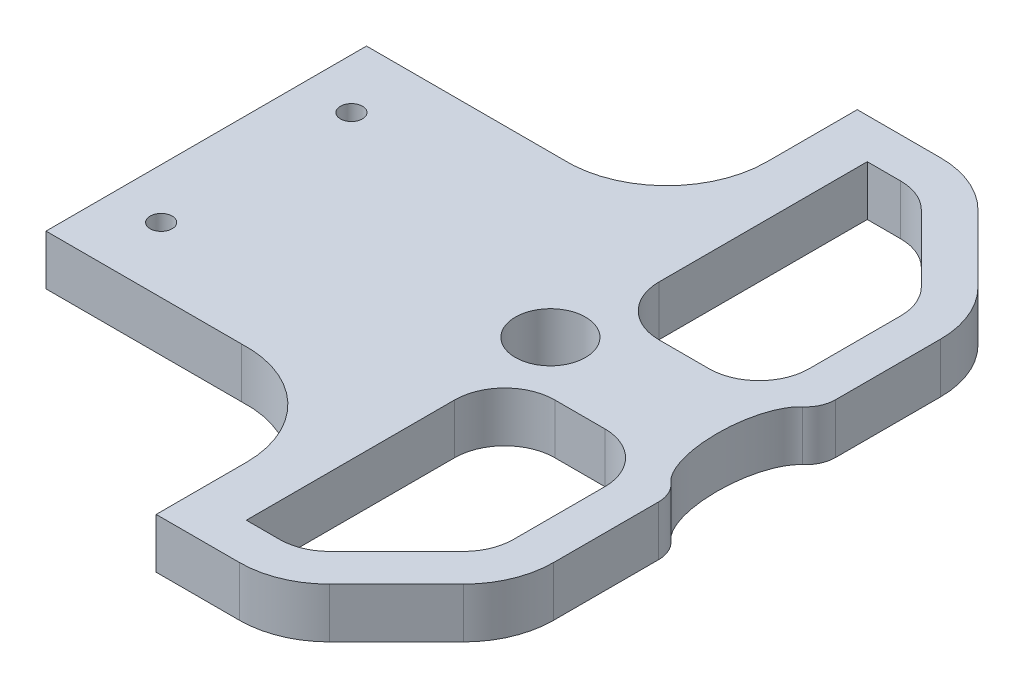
ISO-10303-21;
HEADER;
FILE_DESCRIPTION(('STEP AP214'),'2;1');
FILE_NAME('part.step','',(''),(''),'','','');
FILE_SCHEMA(('AUTOMOTIVE_DESIGN { 1 0 10303 214 1 1 1 1 }'));
ENDSEC;
DATA;
#1=APPLICATION_CONTEXT('core data for automotive mechanical design processes');
#2=APPLICATION_PROTOCOL_DEFINITION('international standard','automotive_design',2000,#1);
#3=PRODUCT_CONTEXT('',#1,'mechanical');
#4=PRODUCT('Part','Part','',(#3));
#5=PRODUCT_RELATED_PRODUCT_CATEGORY('part','',(#4));
#6=PRODUCT_DEFINITION_FORMATION('','',#4);
#7=PRODUCT_DEFINITION_CONTEXT('part definition',#1,'design');
#8=PRODUCT_DEFINITION('design','',#6,#7);
#9=PRODUCT_DEFINITION_SHAPE('','',#8);
#10=(LENGTH_UNIT() NAMED_UNIT(*) SI_UNIT(.MILLI.,.METRE.));
#11=(NAMED_UNIT(*) PLANE_ANGLE_UNIT() SI_UNIT($,.RADIAN.));
#12=(NAMED_UNIT(*) SI_UNIT($,.STERADIAN.) SOLID_ANGLE_UNIT());
#13=UNCERTAINTY_MEASURE_WITH_UNIT(LENGTH_MEASURE(1.E-05),#10,'distance_accuracy_value','');
#14=(GEOMETRIC_REPRESENTATION_CONTEXT(3) GLOBAL_UNCERTAINTY_ASSIGNED_CONTEXT((#13)) GLOBAL_UNIT_ASSIGNED_CONTEXT((#10,
#11,#12)) REPRESENTATION_CONTEXT('',''));
#15=CARTESIAN_POINT('',(0.,0.,0.));
#16=DIRECTION('',(0.,0.,1.));
#17=DIRECTION('',(1.,0.,0.));
#18=AXIS2_PLACEMENT_3D('',#15,#16,#17);
#19=CARTESIAN_POINT('',(332.,5.,0.));
#20=DIRECTION('',(0.,1.,0.));
#21=DIRECTION('',(0.,0.,1.));
#22=AXIS2_PLACEMENT_3D('',#19,#20,#21);
#23=PLANE('',#22);
#24=CARTESIAN_POINT('',(283.,5.,-9.5));
#25=DIRECTION('',(0.,1.,0.));
#26=DIRECTION('',(0.,0.,1.));
#27=AXIS2_PLACEMENT_3D('',#24,#25,#26);
#28=CIRCLE('',#27,1.09999999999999);
#29=CARTESIAN_POINT('',(283.,5.,-8.40000000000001));
#30=VERTEX_POINT('',#29);
#31=EDGE_CURVE('E320',#30,#30,#28,.T.);
#32=ORIENTED_EDGE('',*,*,#31,.F.);
#33=EDGE_LOOP('',(#32));
#34=FACE_BOUND('',#33,.T.);
#35=DIRECTION('',(-1.,0.,0.));
#36=VECTOR('',#35,1.);
#37=CARTESIAN_POINT('',(313.,5.,-31.));
#38=LINE('',#37,#36);
#39=CARTESIAN_POINT('',(316.328932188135,5.,-31.));
#40=VERTEX_POINT('',#39);
#41=CARTESIAN_POINT('',(313.,5.,-31.));
#42=VERTEX_POINT('',#41);
#43=EDGE_CURVE('E363',#40,#42,#38,.T.);
#44=ORIENTED_EDGE('',*,*,#43,.F.);
#45=CARTESIAN_POINT('',(316.328932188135,5.,-26.));
#46=DIRECTION('',(0.,1.,0.));
#47=DIRECTION('',(0.,0.,1.));
#48=AXIS2_PLACEMENT_3D('',#45,#46,#47);
#49=CIRCLE('',#48,4.99999999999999);
#50=CARTESIAN_POINT('',(319.864466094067,5.,-29.5355339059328));
#51=VERTEX_POINT('',#50);
#52=EDGE_CURVE('E361',#51,#40,#49,.T.);
#53=ORIENTED_EDGE('',*,*,#52,.F.);
#54=DIRECTION('',(-0.707106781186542,0.,-0.707106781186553));
#55=VECTOR('',#54,1.);
#56=CARTESIAN_POINT('',(319.864466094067,5.,-29.5355339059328));
#57=LINE('',#56,#55);
#58=CARTESIAN_POINT('',(326.535533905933,5.,-22.8644660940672));
#59=VERTEX_POINT('',#58);
#60=EDGE_CURVE('E379',#59,#51,#57,.T.);
#61=ORIENTED_EDGE('',*,*,#60,.F.);
#62=CARTESIAN_POINT('',(323.,5.,-19.3289321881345));
#63=DIRECTION('',(0.,1.,0.));
#64=DIRECTION('',(0.,0.,1.));
#65=AXIS2_PLACEMENT_3D('',#62,#63,#64);
#66=CIRCLE('',#65,4.99999999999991);
#67=CARTESIAN_POINT('',(328.,5.,-19.3289321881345));
#68=VERTEX_POINT('',#67);
#69=EDGE_CURVE('E376',#68,#59,#66,.T.);
#70=ORIENTED_EDGE('',*,*,#69,.F.);
#71=DIRECTION('',(0.,0.,-1.));
#72=VECTOR('',#71,1.);
#73=CARTESIAN_POINT('',(328.,5.,-10.2));
#74=LINE('',#73,#72);
#75=CARTESIAN_POINT('',(328.,5.,-10.2));
#76=VERTEX_POINT('',#75);
#77=EDGE_CURVE('E374',#76,#68,#74,.T.);
#78=ORIENTED_EDGE('',*,*,#77,.F.);
#79=CARTESIAN_POINT('',(323.,5.,-10.2));
#80=DIRECTION('',(0.,1.,0.));
#81=DIRECTION('',(0.,0.,1.));
#82=AXIS2_PLACEMENT_3D('',#79,#80,#81);
#83=CIRCLE('',#82,4.99999999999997);
#84=CARTESIAN_POINT('',(323.,5.,-5.20000000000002));
#85=VERTEX_POINT('',#84);
#86=EDGE_CURVE('E372',#85,#76,#83,.T.);
#87=ORIENTED_EDGE('',*,*,#86,.F.);
#88=DIRECTION('',(1.,0.,0.));
#89=VECTOR('',#88,1.);
#90=CARTESIAN_POINT('',(323.,5.,-5.19999999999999));
#91=LINE('',#90,#89);
#92=CARTESIAN_POINT('',(318.,5.,-5.19999999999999));
#93=VERTEX_POINT('',#92);
#94=EDGE_CURVE('E370',#93,#85,#91,.T.);
#95=ORIENTED_EDGE('',*,*,#94,.F.);
#96=CARTESIAN_POINT('',(318.,5.,-10.2));
#97=DIRECTION('',(0.,1.,0.));
#98=DIRECTION('',(0.,0.,-1.));
#99=AXIS2_PLACEMENT_3D('',#96,#97,#98);
#100=CIRCLE('',#99,5.00000000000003);
#101=CARTESIAN_POINT('',(313.,5.,-10.2));
#102=VERTEX_POINT('',#101);
#103=EDGE_CURVE('E368',#102,#93,#100,.T.);
#104=ORIENTED_EDGE('',*,*,#103,.F.);
#105=DIRECTION('',(0.,0.,1.));
#106=VECTOR('',#105,1.);
#107=CARTESIAN_POINT('',(313.,5.,-10.2));
#108=LINE('',#107,#106);
#109=EDGE_CURVE('E366',#42,#102,#108,.T.);
#110=ORIENTED_EDGE('',*,*,#109,.F.);
#111=EDGE_LOOP('',(#44,#53,#61,#70,#78,#87,#95,#104,#110));
#112=FACE_BOUND('',#111,.T.);
#113=DIRECTION('',(-1.,0.,0.));
#114=VECTOR('',#113,1.);
#115=CARTESIAN_POINT('',(308.,5.,-35.));
#116=LINE('',#115,#114);
#117=CARTESIAN_POINT('',(316.328932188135,5.,-35.));
#118=VERTEX_POINT('',#117);
#119=CARTESIAN_POINT('',(308.,5.,-35.));
#120=VERTEX_POINT('',#119);
#121=EDGE_CURVE('E427',#118,#120,#116,.T.);
#122=ORIENTED_EDGE('',*,*,#121,.T.);
#123=DIRECTION('',(0.,0.,1.));
#124=VECTOR('',#123,1.);
#125=CARTESIAN_POINT('',(308.,5.,-25.987492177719));
#126=LINE('',#125,#124);
#127=CARTESIAN_POINT('',(308.,5.,-25.987492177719));
#128=VERTEX_POINT('',#127);
#129=EDGE_CURVE('E430',#120,#128,#126,.T.);
#130=ORIENTED_EDGE('',*,*,#129,.T.);
#131=CARTESIAN_POINT('',(298.,5.,-25.987492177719));
#132=DIRECTION('',(0.,-1.,0.));
#133=DIRECTION('',(0.,0.,1.));
#134=AXIS2_PLACEMENT_3D('',#131,#132,#133);
#135=CIRCLE('',#134,10.);
#136=CARTESIAN_POINT('',(297.5,5.,-15.9999999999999));
#137=VERTEX_POINT('',#136);
#138=EDGE_CURVE('E433',#128,#137,#135,.T.);
#139=ORIENTED_EDGE('',*,*,#138,.T.);
#140=DIRECTION('',(-1.,0.,0.));
#141=VECTOR('',#140,1.);
#142=CARTESIAN_POINT('',(278.,5.,-16.));
#143=LINE('',#142,#141);
#144=CARTESIAN_POINT('',(278.,5.,-16.));
#145=VERTEX_POINT('',#144);
#146=EDGE_CURVE('E435',#137,#145,#143,.T.);
#147=ORIENTED_EDGE('',*,*,#146,.T.);
#148=DIRECTION('',(0.,0.,1.));
#149=VECTOR('',#148,1.);
#150=CARTESIAN_POINT('',(278.,5.,-16.));
#151=LINE('',#150,#149);
#152=CARTESIAN_POINT('',(278.,5.,16.));
#153=VERTEX_POINT('',#152);
#154=EDGE_CURVE('E437',#145,#153,#151,.T.);
#155=ORIENTED_EDGE('',*,*,#154,.T.);
#156=DIRECTION('',(1.,0.,0.));
#157=VECTOR('',#156,1.);
#158=CARTESIAN_POINT('',(278.,5.,16.));
#159=LINE('',#158,#157);
#160=CARTESIAN_POINT('',(297.5,5.,16.));
#161=VERTEX_POINT('',#160);
#162=EDGE_CURVE('E439',#153,#161,#159,.T.);
#163=ORIENTED_EDGE('',*,*,#162,.T.);
#164=CARTESIAN_POINT('',(298.,5.,25.987492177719));
#165=DIRECTION('',(0.,-1.,0.));
#166=DIRECTION('',(0.,0.,-1.));
#167=AXIS2_PLACEMENT_3D('',#164,#165,#166);
#168=CIRCLE('',#167,10.);
#169=CARTESIAN_POINT('',(308.,5.,25.987492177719));
#170=VERTEX_POINT('',#169);
#171=EDGE_CURVE('E441',#161,#170,#168,.T.);
#172=ORIENTED_EDGE('',*,*,#171,.T.);
#173=DIRECTION('',(0.,0.,1.));
#174=VECTOR('',#173,1.);
#175=CARTESIAN_POINT('',(308.,5.,25.987492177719));
#176=LINE('',#175,#174);
#177=CARTESIAN_POINT('',(308.,5.,35.));
#178=VERTEX_POINT('',#177);
#179=EDGE_CURVE('E443',#170,#178,#176,.T.);
#180=ORIENTED_EDGE('',*,*,#179,.T.);
#181=DIRECTION('',(1.,0.,0.));
#182=VECTOR('',#181,1.);
#183=CARTESIAN_POINT('',(308.,5.,35.));
#184=LINE('',#183,#182);
#185=CARTESIAN_POINT('',(316.328932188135,5.,35.));
#186=VERTEX_POINT('',#185);
#187=EDGE_CURVE('E445',#178,#186,#184,.T.);
#188=ORIENTED_EDGE('',*,*,#187,.T.);
#189=CARTESIAN_POINT('',(316.328932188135,5.,26.));
#190=DIRECTION('',(0.,1.,0.));
#191=DIRECTION('',(0.,0.,-1.));
#192=AXIS2_PLACEMENT_3D('',#189,#190,#191);
#193=CIRCLE('',#192,8.99999999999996);
#194=CARTESIAN_POINT('',(322.692893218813,5.,32.3639610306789));
#195=VERTEX_POINT('',#194);
#196=EDGE_CURVE('E447',#186,#195,#193,.T.);
#197=ORIENTED_EDGE('',*,*,#196,.T.);
#198=DIRECTION('',(0.70710678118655,0.,-0.707106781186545));
#199=VECTOR('',#198,1.);
#200=CARTESIAN_POINT('',(322.692893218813,5.,32.3639610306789));
#201=LINE('',#200,#199);
#202=CARTESIAN_POINT('',(329.363961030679,5.,25.6928932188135));
#203=VERTEX_POINT('',#202);
#204=EDGE_CURVE('E449',#195,#203,#201,.T.);
#205=ORIENTED_EDGE('',*,*,#204,.T.);
#206=CARTESIAN_POINT('',(323.,5.,19.3289321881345));
#207=DIRECTION('',(0.,1.,0.));
#208=DIRECTION('',(0.,0.,1.));
#209=AXIS2_PLACEMENT_3D('',#206,#207,#208);
#210=CIRCLE('',#209,9.00000000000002);
#211=CARTESIAN_POINT('',(332.,5.,19.3289321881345));
#212=VERTEX_POINT('',#211);
#213=EDGE_CURVE('E451',#203,#212,#210,.T.);
#214=ORIENTED_EDGE('',*,*,#213,.T.);
#215=DIRECTION('',(0.,0.,-1.));
#216=VECTOR('',#215,1.);
#217=CARTESIAN_POINT('',(332.,5.,8.83712997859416));
#218=LINE('',#217,#216);
#219=CARTESIAN_POINT('',(332.,5.,8.83712997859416));
#220=VERTEX_POINT('',#219);
#221=EDGE_CURVE('E453',#212,#220,#218,.T.);
#222=ORIENTED_EDGE('',*,*,#221,.T.);
#223=CARTESIAN_POINT('',(329.,5.,8.83712997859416));
#224=DIRECTION('',(0.,1.,0.));
#225=DIRECTION('',(0.,0.,-1.));
#226=AXIS2_PLACEMENT_3D('',#223,#224,#225);
#227=CIRCLE('',#226,2.99999999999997);
#228=CARTESIAN_POINT('',(330.959643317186,5.,6.56561108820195));
#229=VERTEX_POINT('',#228);
#230=EDGE_CURVE('E455',#220,#229,#227,.T.);
#231=ORIENTED_EDGE('',*,*,#230,.T.);
#232=CARTESIAN_POINT('',(332.,5.,0.));
#233=DIRECTION('',(0.,-1.,0.));
#234=DIRECTION('',(0.,0.,1.));
#235=AXIS2_PLACEMENT_3D('',#232,#233,#234);
#236=ELLIPSE('',#235,7.,3.);
#237=CARTESIAN_POINT('',(330.959643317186,5.,-6.56561108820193));
#238=VERTEX_POINT('',#237);
#239=EDGE_CURVE('E457',#229,#238,#236,.T.);
#240=ORIENTED_EDGE('',*,*,#239,.T.);
#241=CARTESIAN_POINT('',(329.,5.,-8.83712997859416));
#242=DIRECTION('',(0.,1.,0.));
#243=DIRECTION('',(0.,0.,1.));
#244=AXIS2_PLACEMENT_3D('',#241,#242,#243);
#245=CIRCLE('',#244,2.99999999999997);
#246=CARTESIAN_POINT('',(332.,5.,-8.83712997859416));
#247=VERTEX_POINT('',#246);
#248=EDGE_CURVE('E460',#238,#247,#245,.T.);
#249=ORIENTED_EDGE('',*,*,#248,.T.);
#250=DIRECTION('',(0.,0.,-1.));
#251=VECTOR('',#250,1.);
#252=CARTESIAN_POINT('',(332.,5.,-19.3289321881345));
#253=LINE('',#252,#251);
#254=CARTESIAN_POINT('',(332.,5.,-19.3289321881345));
#255=VERTEX_POINT('',#254);
#256=EDGE_CURVE('E716',#247,#255,#253,.T.);
#257=ORIENTED_EDGE('',*,*,#256,.T.);
#258=CARTESIAN_POINT('',(323.,5.,-19.3289321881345));
#259=DIRECTION('',(0.,1.,0.));
#260=DIRECTION('',(0.,0.,-1.));
#261=AXIS2_PLACEMENT_3D('',#258,#259,#260);
#262=CIRCLE('',#261,8.99999999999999);
#263=CARTESIAN_POINT('',(329.363961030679,5.,-25.6928932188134));
#264=VERTEX_POINT('',#263);
#265=EDGE_CURVE('E575',#255,#264,#262,.T.);
#266=ORIENTED_EDGE('',*,*,#265,.T.);
#267=DIRECTION('',(-0.707106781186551,0.,-0.707106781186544));
#268=VECTOR('',#267,1.);
#269=CARTESIAN_POINT('',(322.692893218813,5.,-32.3639610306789));
#270=LINE('',#269,#268);
#271=CARTESIAN_POINT('',(322.692893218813,5.,-32.3639610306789));
#272=VERTEX_POINT('',#271);
#273=EDGE_CURVE('E714',#264,#272,#270,.T.);
#274=ORIENTED_EDGE('',*,*,#273,.T.);
#275=CARTESIAN_POINT('',(316.328932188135,5.,-26.));
#276=DIRECTION('',(0.,1.,0.));
#277=DIRECTION('',(0.,0.,1.));
#278=AXIS2_PLACEMENT_3D('',#275,#276,#277);
#279=CIRCLE('',#278,8.99999999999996);
#280=EDGE_CURVE('E592',#272,#118,#279,.T.);
#281=ORIENTED_EDGE('',*,*,#280,.T.);
#282=EDGE_LOOP('',(#122,#130,#139,#147,#155,#163,#172,#180,#188,#197,#205,#214,#222,#231,#240,
#249,#257,#266,#274,#281));
#283=FACE_BOUND('',#282,.T.);
#284=CARTESIAN_POINT('',(283.,5.,9.5));
#285=DIRECTION('',(0.,1.,0.));
#286=DIRECTION('',(0.,0.,-1.));
#287=AXIS2_PLACEMENT_3D('',#284,#285,#286);
#288=CIRCLE('',#287,1.09999999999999);
#289=CARTESIAN_POINT('',(283.,5.,8.40000000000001));
#290=VERTEX_POINT('',#289);
#291=EDGE_CURVE('E355',#290,#290,#288,.T.);
#292=ORIENTED_EDGE('',*,*,#291,.F.);
#293=EDGE_LOOP('',(#292));
#294=FACE_BOUND('',#293,.T.);
#295=DIRECTION('',(0.,0.,1.));
#296=VECTOR('',#295,1.);
#297=CARTESIAN_POINT('',(313.,5.,10.2));
#298=LINE('',#297,#296);
#299=CARTESIAN_POINT('',(313.,5.,10.2));
#300=VERTEX_POINT('',#299);
#301=CARTESIAN_POINT('',(313.,5.,31.));
#302=VERTEX_POINT('',#301);
#303=EDGE_CURVE('E288',#300,#302,#298,.T.);
#304=ORIENTED_EDGE('',*,*,#303,.F.);
#305=CARTESIAN_POINT('',(318.,5.,10.2));
#306=DIRECTION('',(0.,1.,0.));
#307=DIRECTION('',(0.,0.,1.));
#308=AXIS2_PLACEMENT_3D('',#305,#306,#307);
#309=CIRCLE('',#308,5.00000000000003);
#310=CARTESIAN_POINT('',(318.,5.,5.19999999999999));
#311=VERTEX_POINT('',#310);
#312=EDGE_CURVE('E280',#311,#300,#309,.T.);
#313=ORIENTED_EDGE('',*,*,#312,.F.);
#314=DIRECTION('',(-1.,0.,0.));
#315=VECTOR('',#314,1.);
#316=CARTESIAN_POINT('',(323.,5.,5.19999999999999));
#317=LINE('',#316,#315);
#318=CARTESIAN_POINT('',(323.,5.,5.19999999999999));
#319=VERTEX_POINT('',#318);
#320=EDGE_CURVE('E317',#319,#311,#317,.T.);
#321=ORIENTED_EDGE('',*,*,#320,.F.);
#322=CARTESIAN_POINT('',(323.,5.,10.2));
#323=DIRECTION('',(0.,1.,0.));
#324=DIRECTION('',(0.,0.,-1.));
#325=AXIS2_PLACEMENT_3D('',#322,#323,#324);
#326=CIRCLE('',#325,4.99999999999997);
#327=CARTESIAN_POINT('',(328.,5.,10.2));
#328=VERTEX_POINT('',#327);
#329=EDGE_CURVE('E315',#328,#319,#326,.T.);
#330=ORIENTED_EDGE('',*,*,#329,.F.);
#331=DIRECTION('',(0.,0.,-1.));
#332=VECTOR('',#331,1.);
#333=CARTESIAN_POINT('',(328.,5.,10.2));
#334=LINE('',#333,#332);
#335=CARTESIAN_POINT('',(328.,5.,19.3289321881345));
#336=VERTEX_POINT('',#335);
#337=EDGE_CURVE('E313',#336,#328,#334,.T.);
#338=ORIENTED_EDGE('',*,*,#337,.F.);
#339=CARTESIAN_POINT('',(323.,5.,19.3289321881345));
#340=DIRECTION('',(0.,1.,0.));
#341=DIRECTION('',(0.,0.,-1.));
#342=AXIS2_PLACEMENT_3D('',#339,#340,#341);
#343=CIRCLE('',#342,4.99999999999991);
#344=CARTESIAN_POINT('',(326.535533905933,5.,22.8644660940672));
#345=VERTEX_POINT('',#344);
#346=EDGE_CURVE('E311',#345,#336,#343,.T.);
#347=ORIENTED_EDGE('',*,*,#346,.F.);
#348=DIRECTION('',(0.707106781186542,0.,-0.707106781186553));
#349=VECTOR('',#348,1.);
#350=CARTESIAN_POINT('',(319.864466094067,5.,29.5355339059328));
#351=LINE('',#350,#349);
#352=CARTESIAN_POINT('',(319.864466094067,5.,29.5355339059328));
#353=VERTEX_POINT('',#352);
#354=EDGE_CURVE('E309',#353,#345,#351,.T.);
#355=ORIENTED_EDGE('',*,*,#354,.F.);
#356=CARTESIAN_POINT('',(316.328932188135,5.,26.));
#357=DIRECTION('',(0.,1.,0.));
#358=DIRECTION('',(0.,0.,-1.));
#359=AXIS2_PLACEMENT_3D('',#356,#357,#358);
#360=CIRCLE('',#359,4.99999999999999);
#361=CARTESIAN_POINT('',(316.328932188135,5.,31.));
#362=VERTEX_POINT('',#361);
#363=EDGE_CURVE('E304',#362,#353,#360,.T.);
#364=ORIENTED_EDGE('',*,*,#363,.F.);
#365=DIRECTION('',(1.,0.,0.));
#366=VECTOR('',#365,1.);
#367=CARTESIAN_POINT('',(313.,5.,31.));
#368=LINE('',#367,#366);
#369=EDGE_CURVE('E302',#302,#362,#368,.T.);
#370=ORIENTED_EDGE('',*,*,#369,.F.);
#371=EDGE_LOOP('',(#304,#313,#321,#330,#338,#347,#355,#364,#370));
#372=FACE_BOUND('',#371,.T.);
#373=CARTESIAN_POINT('',(312.364466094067,5.,0.));
#374=DIRECTION('',(0.,1.,0.));
#375=DIRECTION('',(0.,0.,1.));
#376=AXIS2_PLACEMENT_3D('',#373,#374,#375);
#377=CIRCLE('',#376,3.50000000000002);
#378=CARTESIAN_POINT('',(312.364466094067,5.,3.50000000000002));
#379=VERTEX_POINT('',#378);
#380=EDGE_CURVE('E1078',#379,#379,#377,.T.);
#381=ORIENTED_EDGE('',*,*,#380,.F.);
#382=EDGE_LOOP('',(#381));
#383=FACE_BOUND('',#382,.T.);
#384=ADVANCED_FACE('F35',(#34,#112,#283,#294,#372,#383),#23,.T.);
#385=CARTESIAN_POINT('',(332.,0.,0.));
#386=DIRECTION('',(0.,1.,0.));
#387=DIRECTION('',(0.,0.,1.));
#388=AXIS2_PLACEMENT_3D('',#385,#386,#387);
#389=PLANE('',#388);
#390=CARTESIAN_POINT('',(283.,0.,9.5));
#391=DIRECTION('',(0.,1.,0.));
#392=DIRECTION('',(0.,0.,-1.));
#393=AXIS2_PLACEMENT_3D('',#390,#391,#392);
#394=CIRCLE('',#393,1.09999999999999);
#395=CARTESIAN_POINT('',(283.,0.,8.40000000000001));
#396=VERTEX_POINT('',#395);
#397=EDGE_CURVE('E296',#396,#396,#394,.T.);
#398=ORIENTED_EDGE('',*,*,#397,.T.);
#399=EDGE_LOOP('',(#398));
#400=FACE_BOUND('',#399,.T.);
#401=CARTESIAN_POINT('',(316.328932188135,0.,-26.));
#402=DIRECTION('',(0.,1.,0.));
#403=DIRECTION('',(0.,0.,1.));
#404=AXIS2_PLACEMENT_3D('',#401,#402,#403);
#405=CIRCLE('',#404,4.99999999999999);
#406=CARTESIAN_POINT('',(319.864466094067,0.,-29.5355339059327));
#407=VERTEX_POINT('',#406);
#408=CARTESIAN_POINT('',(316.328932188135,0.,-31.));
#409=VERTEX_POINT('',#408);
#410=EDGE_CURVE('E358',#407,#409,#405,.T.);
#411=ORIENTED_EDGE('',*,*,#410,.T.);
#412=DIRECTION('',(-1.,0.,0.));
#413=VECTOR('',#412,1.);
#414=CARTESIAN_POINT('',(313.,0.,-31.));
#415=LINE('',#414,#413);
#416=CARTESIAN_POINT('',(313.,0.,-31.));
#417=VERTEX_POINT('',#416);
#418=EDGE_CURVE('E384',#409,#417,#415,.T.);
#419=ORIENTED_EDGE('',*,*,#418,.T.);
#420=DIRECTION('',(0.,0.,1.));
#421=VECTOR('',#420,1.);
#422=CARTESIAN_POINT('',(313.,0.,-10.2));
#423=LINE('',#422,#421);
#424=CARTESIAN_POINT('',(313.,0.,-10.2));
#425=VERTEX_POINT('',#424);
#426=EDGE_CURVE('E387',#417,#425,#423,.T.);
#427=ORIENTED_EDGE('',*,*,#426,.T.);
#428=CARTESIAN_POINT('',(318.,0.,-10.2));
#429=DIRECTION('',(0.,1.,0.));
#430=DIRECTION('',(0.,0.,-1.));
#431=AXIS2_PLACEMENT_3D('',#428,#429,#430);
#432=CIRCLE('',#431,5.00000000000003);
#433=CARTESIAN_POINT('',(318.,0.,-5.19999999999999));
#434=VERTEX_POINT('',#433);
#435=EDGE_CURVE('E390',#425,#434,#432,.T.);
#436=ORIENTED_EDGE('',*,*,#435,.T.);
#437=DIRECTION('',(1.,0.,0.));
#438=VECTOR('',#437,1.);
#439=CARTESIAN_POINT('',(323.,0.,-5.19999999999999));
#440=LINE('',#439,#438);
#441=CARTESIAN_POINT('',(323.,0.,-5.20000000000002));
#442=VERTEX_POINT('',#441);
#443=EDGE_CURVE('E393',#434,#442,#440,.T.);
#444=ORIENTED_EDGE('',*,*,#443,.T.);
#445=CARTESIAN_POINT('',(323.,0.,-10.2));
#446=DIRECTION('',(0.,1.,0.));
#447=DIRECTION('',(0.,0.,1.));
#448=AXIS2_PLACEMENT_3D('',#445,#446,#447);
#449=CIRCLE('',#448,4.99999999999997);
#450=CARTESIAN_POINT('',(328.,0.,-10.2));
#451=VERTEX_POINT('',#450);
#452=EDGE_CURVE('E396',#442,#451,#449,.T.);
#453=ORIENTED_EDGE('',*,*,#452,.T.);
#454=DIRECTION('',(0.,0.,-1.));
#455=VECTOR('',#454,1.);
#456=CARTESIAN_POINT('',(328.,0.,-10.2));
#457=LINE('',#456,#455);
#458=CARTESIAN_POINT('',(328.,0.,-19.3289321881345));
#459=VERTEX_POINT('',#458);
#460=EDGE_CURVE('E399',#451,#459,#457,.T.);
#461=ORIENTED_EDGE('',*,*,#460,.T.);
#462=CARTESIAN_POINT('',(323.,0.,-19.3289321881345));
#463=DIRECTION('',(0.,1.,0.));
#464=DIRECTION('',(0.,0.,1.));
#465=AXIS2_PLACEMENT_3D('',#462,#463,#464);
#466=CIRCLE('',#465,4.99999999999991);
#467=CARTESIAN_POINT('',(326.535533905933,0.,-22.8644660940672));
#468=VERTEX_POINT('',#467);
#469=EDGE_CURVE('E402',#459,#468,#466,.T.);
#470=ORIENTED_EDGE('',*,*,#469,.T.);
#471=DIRECTION('',(-0.707106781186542,0.,-0.707106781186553));
#472=VECTOR('',#471,1.);
#473=CARTESIAN_POINT('',(319.864466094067,0.,-29.5355339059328));
#474=LINE('',#473,#472);
#475=EDGE_CURVE('E364',#468,#407,#474,.T.);
#476=ORIENTED_EDGE('',*,*,#475,.T.);
#477=EDGE_LOOP('',(#411,#419,#427,#436,#444,#453,#461,#470,#476));
#478=FACE_BOUND('',#477,.T.);
#479=DIRECTION('',(-1.,0.,0.));
#480=VECTOR('',#479,1.);
#481=CARTESIAN_POINT('',(308.,0.,-35.));
#482=LINE('',#481,#480);
#483=CARTESIAN_POINT('',(316.328932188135,0.,-35.));
#484=VERTEX_POINT('',#483);
#485=CARTESIAN_POINT('',(308.,0.,-35.));
#486=VERTEX_POINT('',#485);
#487=EDGE_CURVE('E426',#484,#486,#482,.T.);
#488=ORIENTED_EDGE('',*,*,#487,.F.);
#489=CARTESIAN_POINT('',(316.328932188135,0.,-26.));
#490=DIRECTION('',(0.,1.,0.));
#491=DIRECTION('',(0.,0.,1.));
#492=AXIS2_PLACEMENT_3D('',#489,#490,#491);
#493=CIRCLE('',#492,8.99999999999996);
#494=CARTESIAN_POINT('',(322.692893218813,0.,-32.3639610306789));
#495=VERTEX_POINT('',#494);
#496=EDGE_CURVE('E431',#495,#484,#493,.T.);
#497=ORIENTED_EDGE('',*,*,#496,.F.);
#498=DIRECTION('',(-0.707106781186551,0.,-0.707106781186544));
#499=VECTOR('',#498,1.);
#500=CARTESIAN_POINT('',(322.692893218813,0.,-32.3639610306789));
#501=LINE('',#500,#499);
#502=CARTESIAN_POINT('',(329.363961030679,0.,-25.6928932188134));
#503=VERTEX_POINT('',#502);
#504=EDGE_CURVE('E582',#503,#495,#501,.T.);
#505=ORIENTED_EDGE('',*,*,#504,.F.);
#506=CARTESIAN_POINT('',(323.,0.,-19.3289321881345));
#507=DIRECTION('',(0.,1.,0.));
#508=DIRECTION('',(0.,0.,-1.));
#509=AXIS2_PLACEMENT_3D('',#506,#507,#508);
#510=CIRCLE('',#509,8.99999999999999);
#511=CARTESIAN_POINT('',(332.,0.,-19.3289321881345));
#512=VERTEX_POINT('',#511);
#513=EDGE_CURVE('E570',#512,#503,#510,.T.);
#514=ORIENTED_EDGE('',*,*,#513,.F.);
#515=DIRECTION('',(0.,0.,-1.));
#516=VECTOR('',#515,1.);
#517=CARTESIAN_POINT('',(332.,0.,-19.3289321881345));
#518=LINE('',#517,#516);
#519=CARTESIAN_POINT('',(332.,0.,-8.83712997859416));
#520=VERTEX_POINT('',#519);
#521=EDGE_CURVE('E560',#520,#512,#518,.T.);
#522=ORIENTED_EDGE('',*,*,#521,.F.);
#523=CARTESIAN_POINT('',(329.,0.,-8.83712997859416));
#524=DIRECTION('',(0.,1.,0.));
#525=DIRECTION('',(0.,0.,1.));
#526=AXIS2_PLACEMENT_3D('',#523,#524,#525);
#527=CIRCLE('',#526,2.99999999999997);
#528=CARTESIAN_POINT('',(330.959643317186,0.,-6.56561108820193));
#529=VERTEX_POINT('',#528);
#530=EDGE_CURVE('E571',#529,#520,#527,.T.);
#531=ORIENTED_EDGE('',*,*,#530,.F.);
#532=CARTESIAN_POINT('',(332.,0.,0.));
#533=DIRECTION('',(0.,-1.,0.));
#534=DIRECTION('',(0.,0.,1.));
#535=AXIS2_PLACEMENT_3D('',#532,#533,#534);
#536=ELLIPSE('',#535,7.,3.);
#537=CARTESIAN_POINT('',(330.959643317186,0.,6.56561108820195));
#538=VERTEX_POINT('',#537);
#539=EDGE_CURVE('E670',#538,#529,#536,.T.);
#540=ORIENTED_EDGE('',*,*,#539,.F.);
#541=CARTESIAN_POINT('',(329.,0.,8.83712997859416));
#542=DIRECTION('',(0.,1.,0.));
#543=DIRECTION('',(0.,0.,-1.));
#544=AXIS2_PLACEMENT_3D('',#541,#542,#543);
#545=CIRCLE('',#544,2.99999999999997);
#546=CARTESIAN_POINT('',(332.,0.,8.83712997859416));
#547=VERTEX_POINT('',#546);
#548=EDGE_CURVE('E668',#547,#538,#545,.T.);
#549=ORIENTED_EDGE('',*,*,#548,.F.);
#550=DIRECTION('',(0.,0.,-1.));
#551=VECTOR('',#550,1.);
#552=CARTESIAN_POINT('',(332.,0.,8.83712997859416));
#553=LINE('',#552,#551);
#554=CARTESIAN_POINT('',(332.,0.,19.3289321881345));
#555=VERTEX_POINT('',#554);
#556=EDGE_CURVE('E666',#555,#547,#553,.T.);
#557=ORIENTED_EDGE('',*,*,#556,.F.);
#558=CARTESIAN_POINT('',(323.,0.,19.3289321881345));
#559=DIRECTION('',(0.,1.,0.));
#560=DIRECTION('',(0.,0.,1.));
#561=AXIS2_PLACEMENT_3D('',#558,#559,#560);
#562=CIRCLE('',#561,9.00000000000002);
#563=CARTESIAN_POINT('',(329.363961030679,0.,25.6928932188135));
#564=VERTEX_POINT('',#563);
#565=EDGE_CURVE('E664',#564,#555,#562,.T.);
#566=ORIENTED_EDGE('',*,*,#565,.F.);
#567=DIRECTION('',(0.70710678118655,0.,-0.707106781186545));
#568=VECTOR('',#567,1.);
#569=CARTESIAN_POINT('',(322.692893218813,0.,32.3639610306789));
#570=LINE('',#569,#568);
#571=CARTESIAN_POINT('',(322.692893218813,0.,32.3639610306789));
#572=VERTEX_POINT('',#571);
#573=EDGE_CURVE('E662',#572,#564,#570,.T.);
#574=ORIENTED_EDGE('',*,*,#573,.F.);
#575=CARTESIAN_POINT('',(316.328932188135,0.,26.));
#576=DIRECTION('',(0.,1.,0.));
#577=DIRECTION('',(0.,0.,-1.));
#578=AXIS2_PLACEMENT_3D('',#575,#576,#577);
#579=CIRCLE('',#578,8.99999999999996);
#580=CARTESIAN_POINT('',(316.328932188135,0.,35.));
#581=VERTEX_POINT('',#580);
#582=EDGE_CURVE('E660',#581,#572,#579,.T.);
#583=ORIENTED_EDGE('',*,*,#582,.F.);
#584=DIRECTION('',(1.,0.,0.));
#585=VECTOR('',#584,1.);
#586=CARTESIAN_POINT('',(308.,0.,35.));
#587=LINE('',#586,#585);
#588=CARTESIAN_POINT('',(308.,0.,35.));
#589=VERTEX_POINT('',#588);
#590=EDGE_CURVE('E658',#589,#581,#587,.T.);
#591=ORIENTED_EDGE('',*,*,#590,.F.);
#592=DIRECTION('',(0.,0.,1.));
#593=VECTOR('',#592,1.);
#594=CARTESIAN_POINT('',(308.,0.,25.987492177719));
#595=LINE('',#594,#593);
#596=CARTESIAN_POINT('',(308.,0.,25.987492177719));
#597=VERTEX_POINT('',#596);
#598=EDGE_CURVE('E656',#597,#589,#595,.T.);
#599=ORIENTED_EDGE('',*,*,#598,.F.);
#600=CARTESIAN_POINT('',(298.,0.,25.987492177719));
#601=DIRECTION('',(0.,-1.,0.));
#602=DIRECTION('',(0.,0.,-1.));
#603=AXIS2_PLACEMENT_3D('',#600,#601,#602);
#604=CIRCLE('',#603,10.);
#605=CARTESIAN_POINT('',(297.5,0.,16.));
#606=VERTEX_POINT('',#605);
#607=EDGE_CURVE('E654',#606,#597,#604,.T.);
#608=ORIENTED_EDGE('',*,*,#607,.F.);
#609=DIRECTION('',(1.,0.,0.));
#610=VECTOR('',#609,1.);
#611=CARTESIAN_POINT('',(278.,0.,16.));
#612=LINE('',#611,#610);
#613=CARTESIAN_POINT('',(278.,0.,16.));
#614=VERTEX_POINT('',#613);
#615=EDGE_CURVE('E652',#614,#606,#612,.T.);
#616=ORIENTED_EDGE('',*,*,#615,.F.);
#617=DIRECTION('',(0.,0.,1.));
#618=VECTOR('',#617,1.);
#619=CARTESIAN_POINT('',(278.,0.,-16.));
#620=LINE('',#619,#618);
#621=CARTESIAN_POINT('',(278.,0.,-16.));
#622=VERTEX_POINT('',#621);
#623=EDGE_CURVE('E646',#622,#614,#620,.T.);
#624=ORIENTED_EDGE('',*,*,#623,.F.);
#625=DIRECTION('',(-1.,0.,0.));
#626=VECTOR('',#625,1.);
#627=CARTESIAN_POINT('',(278.,0.,-16.));
#628=LINE('',#627,#626);
#629=CARTESIAN_POINT('',(297.5,0.,-15.9999999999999));
#630=VERTEX_POINT('',#629);
#631=EDGE_CURVE('E644',#630,#622,#628,.T.);
#632=ORIENTED_EDGE('',*,*,#631,.F.);
#633=CARTESIAN_POINT('',(298.,0.,-25.987492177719));
#634=DIRECTION('',(0.,-1.,0.));
#635=DIRECTION('',(0.,0.,1.));
#636=AXIS2_PLACEMENT_3D('',#633,#634,#635);
#637=CIRCLE('',#636,10.);
#638=CARTESIAN_POINT('',(308.,0.,-25.987492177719));
#639=VERTEX_POINT('',#638);
#640=EDGE_CURVE('E640',#639,#630,#637,.T.);
#641=ORIENTED_EDGE('',*,*,#640,.F.);
#642=DIRECTION('',(0.,0.,1.));
#643=VECTOR('',#642,1.);
#644=CARTESIAN_POINT('',(308.,0.,-25.987492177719));
#645=LINE('',#644,#643);
#646=EDGE_CURVE('E642',#486,#639,#645,.T.);
#647=ORIENTED_EDGE('',*,*,#646,.F.);
#648=EDGE_LOOP('',(#488,#497,#505,#514,#522,#531,#540,#549,#557,#566,#574,#583,#591,#599,#608,
#616,#624,#632,#641,#647));
#649=FACE_BOUND('',#648,.T.);
#650=CARTESIAN_POINT('',(318.,0.,10.2));
#651=DIRECTION('',(0.,1.,0.));
#652=DIRECTION('',(0.,0.,1.));
#653=AXIS2_PLACEMENT_3D('',#650,#651,#652);
#654=CIRCLE('',#653,5.00000000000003);
#655=CARTESIAN_POINT('',(318.,0.,5.19999999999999));
#656=VERTEX_POINT('',#655);
#657=CARTESIAN_POINT('',(313.,0.,10.2));
#658=VERTEX_POINT('',#657);
#659=EDGE_CURVE('E58',#656,#658,#654,.T.);
#660=ORIENTED_EDGE('',*,*,#659,.T.);
#661=DIRECTION('',(0.,0.,1.));
#662=VECTOR('',#661,1.);
#663=CARTESIAN_POINT('',(313.,0.,10.2));
#664=LINE('',#663,#662);
#665=CARTESIAN_POINT('',(313.,0.,31.));
#666=VERTEX_POINT('',#665);
#667=EDGE_CURVE('E295',#658,#666,#664,.T.);
#668=ORIENTED_EDGE('',*,*,#667,.T.);
#669=DIRECTION('',(1.,0.,0.));
#670=VECTOR('',#669,1.);
#671=CARTESIAN_POINT('',(313.,0.,31.));
#672=LINE('',#671,#670);
#673=CARTESIAN_POINT('',(316.328932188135,0.,31.));
#674=VERTEX_POINT('',#673);
#675=EDGE_CURVE('E322',#666,#674,#672,.T.);
#676=ORIENTED_EDGE('',*,*,#675,.T.);
#677=CARTESIAN_POINT('',(316.328932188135,0.,26.));
#678=DIRECTION('',(0.,1.,0.));
#679=DIRECTION('',(0.,0.,-1.));
#680=AXIS2_PLACEMENT_3D('',#677,#678,#679);
#681=CIRCLE('',#680,4.99999999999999);
#682=CARTESIAN_POINT('',(319.864466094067,0.,29.5355339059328));
#683=VERTEX_POINT('',#682);
#684=EDGE_CURVE('E325',#674,#683,#681,.T.);
#685=ORIENTED_EDGE('',*,*,#684,.T.);
#686=DIRECTION('',(0.707106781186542,0.,-0.707106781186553));
#687=VECTOR('',#686,1.);
#688=CARTESIAN_POINT('',(319.864466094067,0.,29.5355339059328));
#689=LINE('',#688,#687);
#690=CARTESIAN_POINT('',(326.535533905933,0.,22.8644660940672));
#691=VERTEX_POINT('',#690);
#692=EDGE_CURVE('E328',#683,#691,#689,.T.);
#693=ORIENTED_EDGE('',*,*,#692,.T.);
#694=CARTESIAN_POINT('',(323.,0.,19.3289321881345));
#695=DIRECTION('',(0.,1.,0.));
#696=DIRECTION('',(0.,0.,-1.));
#697=AXIS2_PLACEMENT_3D('',#694,#695,#696);
#698=CIRCLE('',#697,4.99999999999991);
#699=CARTESIAN_POINT('',(328.,0.,19.3289321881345));
#700=VERTEX_POINT('',#699);
#701=EDGE_CURVE('E331',#691,#700,#698,.T.);
#702=ORIENTED_EDGE('',*,*,#701,.T.);
#703=DIRECTION('',(0.,0.,-1.));
#704=VECTOR('',#703,1.);
#705=CARTESIAN_POINT('',(328.,0.,10.2));
#706=LINE('',#705,#704);
#707=CARTESIAN_POINT('',(328.,0.,10.2));
#708=VERTEX_POINT('',#707);
#709=EDGE_CURVE('E334',#700,#708,#706,.T.);
#710=ORIENTED_EDGE('',*,*,#709,.T.);
#711=CARTESIAN_POINT('',(323.,0.,10.2));
#712=DIRECTION('',(0.,1.,0.));
#713=DIRECTION('',(0.,0.,-1.));
#714=AXIS2_PLACEMENT_3D('',#711,#712,#713);
#715=CIRCLE('',#714,4.99999999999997);
#716=CARTESIAN_POINT('',(323.,0.,5.19999999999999));
#717=VERTEX_POINT('',#716);
#718=EDGE_CURVE('E337',#708,#717,#715,.T.);
#719=ORIENTED_EDGE('',*,*,#718,.T.);
#720=DIRECTION('',(-1.,0.,0.));
#721=VECTOR('',#720,1.);
#722=CARTESIAN_POINT('',(323.,0.,5.19999999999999));
#723=LINE('',#722,#721);
#724=EDGE_CURVE('E289',#717,#656,#723,.T.);
#725=ORIENTED_EDGE('',*,*,#724,.T.);
#726=EDGE_LOOP('',(#660,#668,#676,#685,#693,#702,#710,#719,#725));
#727=FACE_BOUND('',#726,.T.);
#728=CARTESIAN_POINT('',(283.,0.,-9.5));
#729=DIRECTION('',(0.,1.,0.));
#730=DIRECTION('',(0.,0.,1.));
#731=AXIS2_PLACEMENT_3D('',#728,#729,#730);
#732=CIRCLE('',#731,1.09999999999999);
#733=CARTESIAN_POINT('',(283.,0.,-8.40000000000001));
#734=VERTEX_POINT('',#733);
#735=EDGE_CURVE('E1084',#734,#734,#732,.T.);
#736=ORIENTED_EDGE('',*,*,#735,.T.);
#737=EDGE_LOOP('',(#736));
#738=FACE_BOUND('',#737,.T.);
#739=CARTESIAN_POINT('',(312.364466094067,0.,0.));
#740=DIRECTION('',(0.,1.,0.));
#741=DIRECTION('',(0.,0.,1.));
#742=AXIS2_PLACEMENT_3D('',#739,#740,#741);
#743=CIRCLE('',#742,3.50000000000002);
#744=CARTESIAN_POINT('',(312.364466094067,0.,3.50000000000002));
#745=VERTEX_POINT('',#744);
#746=EDGE_CURVE('E1081',#745,#745,#743,.T.);
#747=ORIENTED_EDGE('',*,*,#746,.T.);
#748=EDGE_LOOP('',(#747));
#749=FACE_BOUND('',#748,.T.);
#750=ADVANCED_FACE('F523',(#400,#478,#649,#727,#738,#749),#389,.F.);
#751=CARTESIAN_POINT('',(308.,5.,-35.));
#752=DIRECTION('',(0.,0.,1.));
#753=DIRECTION('',(1.,0.,0.));
#754=AXIS2_PLACEMENT_3D('',#751,#752,#753);
#755=PLANE('',#754);
#756=ORIENTED_EDGE('',*,*,#487,.T.);
#757=DIRECTION('',(0.,-1.,0.));
#758=VECTOR('',#757,1.);
#759=CARTESIAN_POINT('',(308.,5.,-35.));
#760=LINE('',#759,#758);
#761=EDGE_CURVE('E11',#120,#486,#760,.T.);
#762=ORIENTED_EDGE('',*,*,#761,.F.);
#763=ORIENTED_EDGE('',*,*,#121,.F.);
#764=DIRECTION('',(0.,-1.,0.));
#765=VECTOR('',#764,1.);
#766=CARTESIAN_POINT('',(316.328932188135,5.,-35.));
#767=LINE('',#766,#765);
#768=EDGE_CURVE('E588',#118,#484,#767,.T.);
#769=ORIENTED_EDGE('',*,*,#768,.T.);
#770=EDGE_LOOP('',(#756,#762,#763,#769));
#771=FACE_BOUND('',#770,.T.);
#772=ADVANCED_FACE('F37',(#771),#755,.F.);
#773=CARTESIAN_POINT('',(308.,5.,-25.987492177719));
#774=DIRECTION('',(1.,0.,0.));
#775=DIRECTION('',(0.,0.,-1.));
#776=AXIS2_PLACEMENT_3D('',#773,#774,#775);
#777=PLANE('',#776);
#778=ORIENTED_EDGE('',*,*,#646,.T.);
#779=DIRECTION('',(0.,-1.,0.));
#780=VECTOR('',#779,1.);
#781=CARTESIAN_POINT('',(308.,5.,-25.987492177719));
#782=LINE('',#781,#780);
#783=EDGE_CURVE('E43',#128,#639,#782,.T.);
#784=ORIENTED_EDGE('',*,*,#783,.F.);
#785=ORIENTED_EDGE('',*,*,#129,.F.);
#786=ORIENTED_EDGE('',*,*,#761,.T.);
#787=EDGE_LOOP('',(#778,#784,#785,#786));
#788=FACE_BOUND('',#787,.T.);
#789=ADVANCED_FACE('F516',(#788),#777,.F.);
#790=CARTESIAN_POINT('',(298.,5.,-25.987492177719));
#791=DIRECTION('',(0.,-1.,0.));
#792=DIRECTION('',(0.,0.,-1.));
#793=AXIS2_PLACEMENT_3D('',#790,#791,#792);
#794=CYLINDRICAL_SURFACE('',#793,10.);
#795=ORIENTED_EDGE('',*,*,#640,.T.);
#796=DIRECTION('',(0.,-1.,0.));
#797=VECTOR('',#796,1.);
#798=CARTESIAN_POINT('',(297.5,5.,-15.9999999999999));
#799=LINE('',#798,#797);
#800=EDGE_CURVE('E633',#137,#630,#799,.T.);
#801=ORIENTED_EDGE('',*,*,#800,.F.);
#802=ORIENTED_EDGE('',*,*,#138,.F.);
#803=ORIENTED_EDGE('',*,*,#783,.T.);
#804=EDGE_LOOP('',(#795,#801,#802,#803));
#805=FACE_BOUND('',#804,.T.);
#806=ADVANCED_FACE('F513',(#805),#794,.F.);
#807=CARTESIAN_POINT('',(278.,5.,-16.));
#808=DIRECTION('',(0.,0.,1.));
#809=DIRECTION('',(1.,0.,0.));
#810=AXIS2_PLACEMENT_3D('',#807,#808,#809);
#811=PLANE('',#810);
#812=ORIENTED_EDGE('',*,*,#631,.T.);
#813=DIRECTION('',(0.,-1.,0.));
#814=VECTOR('',#813,1.);
#815=CARTESIAN_POINT('',(278.,5.,-16.));
#816=LINE('',#815,#814);
#817=EDGE_CURVE('E630',#145,#622,#816,.T.);
#818=ORIENTED_EDGE('',*,*,#817,.F.);
#819=ORIENTED_EDGE('',*,*,#146,.F.);
#820=ORIENTED_EDGE('',*,*,#800,.T.);
#821=EDGE_LOOP('',(#812,#818,#819,#820));
#822=FACE_BOUND('',#821,.T.);
#823=ADVANCED_FACE('F509',(#822),#811,.F.);
#824=CARTESIAN_POINT('',(278.,5.,-16.));
#825=DIRECTION('',(1.,0.,0.));
#826=DIRECTION('',(0.,0.,-1.));
#827=AXIS2_PLACEMENT_3D('',#824,#825,#826);
#828=PLANE('',#827);
#829=ORIENTED_EDGE('',*,*,#623,.T.);
#830=DIRECTION('',(0.,-1.,0.));
#831=VECTOR('',#830,1.);
#832=CARTESIAN_POINT('',(278.,5.,16.));
#833=LINE('',#832,#831);
#834=EDGE_CURVE('E627',#153,#614,#833,.T.);
#835=ORIENTED_EDGE('',*,*,#834,.F.);
#836=ORIENTED_EDGE('',*,*,#154,.F.);
#837=ORIENTED_EDGE('',*,*,#817,.T.);
#838=EDGE_LOOP('',(#829,#835,#836,#837));
#839=FACE_BOUND('',#838,.T.);
#840=ADVANCED_FACE('F505',(#839),#828,.F.);
#841=CARTESIAN_POINT('',(278.,5.,16.));
#842=DIRECTION('',(0.,0.,-1.));
#843=DIRECTION('',(-1.,0.,0.));
#844=AXIS2_PLACEMENT_3D('',#841,#842,#843);
#845=PLANE('',#844);
#846=ORIENTED_EDGE('',*,*,#615,.T.);
#847=DIRECTION('',(0.,-1.,0.));
#848=VECTOR('',#847,1.);
#849=CARTESIAN_POINT('',(297.5,5.,16.));
#850=LINE('',#849,#848);
#851=EDGE_CURVE('E624',#161,#606,#850,.T.);
#852=ORIENTED_EDGE('',*,*,#851,.F.);
#853=ORIENTED_EDGE('',*,*,#162,.F.);
#854=ORIENTED_EDGE('',*,*,#834,.T.);
#855=EDGE_LOOP('',(#846,#852,#853,#854));
#856=FACE_BOUND('',#855,.T.);
#857=ADVANCED_FACE('F501',(#856),#845,.F.);
#858=CARTESIAN_POINT('',(298.,5.,25.987492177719));
#859=DIRECTION('',(0.,-1.,0.));
#860=DIRECTION('',(0.,0.,-1.));
#861=AXIS2_PLACEMENT_3D('',#858,#859,#860);
#862=CYLINDRICAL_SURFACE('',#861,10.);
#863=ORIENTED_EDGE('',*,*,#607,.T.);
#864=DIRECTION('',(0.,-1.,0.));
#865=VECTOR('',#864,1.);
#866=CARTESIAN_POINT('',(308.,5.,25.987492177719));
#867=LINE('',#866,#865);
#868=EDGE_CURVE('E621',#170,#597,#867,.T.);
#869=ORIENTED_EDGE('',*,*,#868,.F.);
#870=ORIENTED_EDGE('',*,*,#171,.F.);
#871=ORIENTED_EDGE('',*,*,#851,.T.);
#872=EDGE_LOOP('',(#863,#869,#870,#871));
#873=FACE_BOUND('',#872,.T.);
#874=ADVANCED_FACE('F497',(#873),#862,.F.);
#875=CARTESIAN_POINT('',(308.,5.,25.987492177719));
#876=DIRECTION('',(1.,0.,0.));
#877=DIRECTION('',(0.,0.,-1.));
#878=AXIS2_PLACEMENT_3D('',#875,#876,#877);
#879=PLANE('',#878);
#880=ORIENTED_EDGE('',*,*,#598,.T.);
#881=DIRECTION('',(0.,-1.,0.));
#882=VECTOR('',#881,1.);
#883=CARTESIAN_POINT('',(308.,5.,35.));
#884=LINE('',#883,#882);
#885=EDGE_CURVE('E618',#178,#589,#884,.T.);
#886=ORIENTED_EDGE('',*,*,#885,.F.);
#887=ORIENTED_EDGE('',*,*,#179,.F.);
#888=ORIENTED_EDGE('',*,*,#868,.T.);
#889=EDGE_LOOP('',(#880,#886,#887,#888));
#890=FACE_BOUND('',#889,.T.);
#891=ADVANCED_FACE('F493',(#890),#879,.F.);
#892=CARTESIAN_POINT('',(308.,5.,35.));
#893=DIRECTION('',(0.,0.,-1.));
#894=DIRECTION('',(-1.,0.,0.));
#895=AXIS2_PLACEMENT_3D('',#892,#893,#894);
#896=PLANE('',#895);
#897=ORIENTED_EDGE('',*,*,#590,.T.);
#898=DIRECTION('',(0.,-1.,0.));
#899=VECTOR('',#898,1.);
#900=CARTESIAN_POINT('',(316.328932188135,5.,35.));
#901=LINE('',#900,#899);
#902=EDGE_CURVE('E615',#186,#581,#901,.T.);
#903=ORIENTED_EDGE('',*,*,#902,.F.);
#904=ORIENTED_EDGE('',*,*,#187,.F.);
#905=ORIENTED_EDGE('',*,*,#885,.T.);
#906=EDGE_LOOP('',(#897,#903,#904,#905));
#907=FACE_BOUND('',#906,.T.);
#908=ADVANCED_FACE('F489',(#907),#896,.F.);
#909=CARTESIAN_POINT('',(316.328932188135,5.,26.));
#910=DIRECTION('',(0.,-1.,0.));
#911=DIRECTION('',(0.,0.,-1.));
#912=AXIS2_PLACEMENT_3D('',#909,#910,#911);
#913=CYLINDRICAL_SURFACE('',#912,8.99999999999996);
#914=ORIENTED_EDGE('',*,*,#582,.T.);
#915=DIRECTION('',(0.,-1.,0.));
#916=VECTOR('',#915,1.);
#917=CARTESIAN_POINT('',(322.692893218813,5.,32.3639610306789));
#918=LINE('',#917,#916);
#919=EDGE_CURVE('E612',#195,#572,#918,.T.);
#920=ORIENTED_EDGE('',*,*,#919,.F.);
#921=ORIENTED_EDGE('',*,*,#196,.F.);
#922=ORIENTED_EDGE('',*,*,#902,.T.);
#923=EDGE_LOOP('',(#914,#920,#921,#922));
#924=FACE_BOUND('',#923,.T.);
#925=ADVANCED_FACE('F485',(#924),#913,.T.);
#926=CARTESIAN_POINT('',(322.692893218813,5.,32.3639610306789));
#927=DIRECTION('',(-0.707106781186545,0.,-0.70710678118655));
#928=DIRECTION('',(-0.70710678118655,0.,0.707106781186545));
#929=AXIS2_PLACEMENT_3D('',#926,#927,#928);
#930=PLANE('',#929);
#931=ORIENTED_EDGE('',*,*,#573,.T.);
#932=DIRECTION('',(0.,-1.,0.));
#933=VECTOR('',#932,1.);
#934=CARTESIAN_POINT('',(329.363961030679,5.,25.6928932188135));
#935=LINE('',#934,#933);
#936=EDGE_CURVE('E609',#203,#564,#935,.T.);
#937=ORIENTED_EDGE('',*,*,#936,.F.);
#938=ORIENTED_EDGE('',*,*,#204,.F.);
#939=ORIENTED_EDGE('',*,*,#919,.T.);
#940=EDGE_LOOP('',(#931,#937,#938,#939));
#941=FACE_BOUND('',#940,.T.);
#942=ADVANCED_FACE('F481',(#941),#930,.F.);
#943=CARTESIAN_POINT('',(323.,5.,19.3289321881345));
#944=DIRECTION('',(0.,-1.,0.));
#945=DIRECTION('',(0.,0.,-1.));
#946=AXIS2_PLACEMENT_3D('',#943,#944,#945);
#947=CYLINDRICAL_SURFACE('',#946,9.00000000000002);
#948=ORIENTED_EDGE('',*,*,#565,.T.);
#949=DIRECTION('',(0.,-1.,0.));
#950=VECTOR('',#949,1.);
#951=CARTESIAN_POINT('',(332.,5.,19.3289321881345));
#952=LINE('',#951,#950);
#953=EDGE_CURVE('E606',#212,#555,#952,.T.);
#954=ORIENTED_EDGE('',*,*,#953,.F.);
#955=ORIENTED_EDGE('',*,*,#213,.F.);
#956=ORIENTED_EDGE('',*,*,#936,.T.);
#957=EDGE_LOOP('',(#948,#954,#955,#956));
#958=FACE_BOUND('',#957,.T.);
#959=ADVANCED_FACE('F477',(#958),#947,.T.);
#960=CARTESIAN_POINT('',(332.,5.,8.83712997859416));
#961=DIRECTION('',(-1.,0.,0.));
#962=DIRECTION('',(0.,0.,1.));
#963=AXIS2_PLACEMENT_3D('',#960,#961,#962);
#964=PLANE('',#963);
#965=ORIENTED_EDGE('',*,*,#556,.T.);
#966=DIRECTION('',(0.,-1.,0.));
#967=VECTOR('',#966,1.);
#968=CARTESIAN_POINT('',(332.,5.,8.83712997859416));
#969=LINE('',#968,#967);
#970=EDGE_CURVE('E603',#220,#547,#969,.T.);
#971=ORIENTED_EDGE('',*,*,#970,.F.);
#972=ORIENTED_EDGE('',*,*,#221,.F.);
#973=ORIENTED_EDGE('',*,*,#953,.T.);
#974=EDGE_LOOP('',(#965,#971,#972,#973));
#975=FACE_BOUND('',#974,.T.);
#976=ADVANCED_FACE('F473',(#975),#964,.F.);
#977=CARTESIAN_POINT('',(329.,5.,8.83712997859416));
#978=DIRECTION('',(0.,-1.,0.));
#979=DIRECTION('',(0.,0.,-1.));
#980=AXIS2_PLACEMENT_3D('',#977,#978,#979);
#981=CYLINDRICAL_SURFACE('',#980,2.99999999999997);
#982=ORIENTED_EDGE('',*,*,#548,.T.);
#983=DIRECTION('',(0.,-1.,0.));
#984=VECTOR('',#983,1.);
#985=CARTESIAN_POINT('',(330.959643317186,5.,6.56561108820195));
#986=LINE('',#985,#984);
#987=EDGE_CURVE('E600',#229,#538,#986,.T.);
#988=ORIENTED_EDGE('',*,*,#987,.F.);
#989=ORIENTED_EDGE('',*,*,#230,.F.);
#990=ORIENTED_EDGE('',*,*,#970,.T.);
#991=EDGE_LOOP('',(#982,#988,#989,#990));
#992=FACE_BOUND('',#991,.T.);
#993=ADVANCED_FACE('F468',(#992),#981,.T.);
#994=DIRECTION('',(0.,-1.,0.));
#995=VECTOR('',#994,1.);
#996=SURFACE_OF_LINEAR_EXTRUSION('',#236,#995);
#997=ORIENTED_EDGE('',*,*,#539,.T.);
#998=DIRECTION('',(0.,-1.,0.));
#999=VECTOR('',#998,1.);
#1000=CARTESIAN_POINT('',(330.959643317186,5.,-6.56561108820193));
#1001=LINE('',#1000,#999);
#1002=EDGE_CURVE('E597',#238,#529,#1001,.T.);
#1003=ORIENTED_EDGE('',*,*,#1002,.F.);
#1004=ORIENTED_EDGE('',*,*,#239,.F.);
#1005=ORIENTED_EDGE('',*,*,#987,.T.);
#1006=EDGE_LOOP('',(#997,#1003,#1004,#1005));
#1007=FACE_BOUND('',#1006,.T.);
#1008=ADVANCED_FACE('F463',(#1007),#996,.F.);
#1009=CARTESIAN_POINT('',(329.,5.,-8.83712997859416));
#1010=DIRECTION('',(0.,-1.,0.));
#1011=DIRECTION('',(0.,0.,-1.));
#1012=AXIS2_PLACEMENT_3D('',#1009,#1010,#1011);
#1013=CYLINDRICAL_SURFACE('',#1012,2.99999999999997);
#1014=ORIENTED_EDGE('',*,*,#530,.T.);
#1015=DIRECTION('',(0.,-1.,0.));
#1016=VECTOR('',#1015,1.);
#1017=CARTESIAN_POINT('',(332.,5.,-8.83712997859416));
#1018=LINE('',#1017,#1016);
#1019=EDGE_CURVE('E566',#247,#520,#1018,.T.);
#1020=ORIENTED_EDGE('',*,*,#1019,.F.);
#1021=ORIENTED_EDGE('',*,*,#248,.F.);
#1022=ORIENTED_EDGE('',*,*,#1002,.T.);
#1023=EDGE_LOOP('',(#1014,#1020,#1021,#1022));
#1024=FACE_BOUND('',#1023,.T.);
#1025=ADVANCED_FACE('F467',(#1024),#1013,.T.);
#1026=CARTESIAN_POINT('',(332.,5.,-19.3289321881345));
#1027=DIRECTION('',(-1.,0.,0.));
#1028=DIRECTION('',(0.,0.,1.));
#1029=AXIS2_PLACEMENT_3D('',#1026,#1027,#1028);
#1030=PLANE('',#1029);
#1031=ORIENTED_EDGE('',*,*,#521,.T.);
#1032=DIRECTION('',(0.,-1.,0.));
#1033=VECTOR('',#1032,1.);
#1034=CARTESIAN_POINT('',(332.,5.,-19.3289321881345));
#1035=LINE('',#1034,#1033);
#1036=EDGE_CURVE('E563',#255,#512,#1035,.T.);
#1037=ORIENTED_EDGE('',*,*,#1036,.F.);
#1038=ORIENTED_EDGE('',*,*,#256,.F.);
#1039=ORIENTED_EDGE('',*,*,#1019,.T.);
#1040=EDGE_LOOP('',(#1031,#1037,#1038,#1039));
#1041=FACE_BOUND('',#1040,.T.);
#1042=ADVANCED_FACE('F549',(#1041),#1030,.F.);
#1043=CARTESIAN_POINT('',(323.,5.,-19.3289321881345));
#1044=DIRECTION('',(0.,-1.,0.));
#1045=DIRECTION('',(0.,0.,-1.));
#1046=AXIS2_PLACEMENT_3D('',#1043,#1044,#1045);
#1047=CYLINDRICAL_SURFACE('',#1046,8.99999999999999);
#1048=ORIENTED_EDGE('',*,*,#513,.T.);
#1049=DIRECTION('',(0.,-1.,0.));
#1050=VECTOR('',#1049,1.);
#1051=CARTESIAN_POINT('',(329.363961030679,5.,-25.6928932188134));
#1052=LINE('',#1051,#1050);
#1053=EDGE_CURVE('E576',#264,#503,#1052,.T.);
#1054=ORIENTED_EDGE('',*,*,#1053,.F.);
#1055=ORIENTED_EDGE('',*,*,#265,.F.);
#1056=ORIENTED_EDGE('',*,*,#1036,.T.);
#1057=EDGE_LOOP('',(#1048,#1054,#1055,#1056));
#1058=FACE_BOUND('',#1057,.T.);
#1059=ADVANCED_FACE('F546',(#1058),#1047,.T.);
#1060=CARTESIAN_POINT('',(322.692893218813,5.,-32.3639610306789));
#1061=DIRECTION('',(-0.707106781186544,0.,0.707106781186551));
#1062=DIRECTION('',(0.707106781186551,0.,0.707106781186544));
#1063=AXIS2_PLACEMENT_3D('',#1060,#1061,#1062);
#1064=PLANE('',#1063);
#1065=ORIENTED_EDGE('',*,*,#504,.T.);
#1066=DIRECTION('',(0.,-1.,0.));
#1067=VECTOR('',#1066,1.);
#1068=CARTESIAN_POINT('',(322.692893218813,5.,-32.3639610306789));
#1069=LINE('',#1068,#1067);
#1070=EDGE_CURVE('E591',#272,#495,#1069,.T.);
#1071=ORIENTED_EDGE('',*,*,#1070,.F.);
#1072=ORIENTED_EDGE('',*,*,#273,.F.);
#1073=ORIENTED_EDGE('',*,*,#1053,.T.);
#1074=EDGE_LOOP('',(#1065,#1071,#1072,#1073));
#1075=FACE_BOUND('',#1074,.T.);
#1076=ADVANCED_FACE('F542',(#1075),#1064,.F.);
#1077=CARTESIAN_POINT('',(316.328932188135,5.,-26.));
#1078=DIRECTION('',(0.,-1.,0.));
#1079=DIRECTION('',(0.,0.,-1.));
#1080=AXIS2_PLACEMENT_3D('',#1077,#1078,#1079);
#1081=CYLINDRICAL_SURFACE('',#1080,8.99999999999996);
#1082=ORIENTED_EDGE('',*,*,#496,.T.);
#1083=ORIENTED_EDGE('',*,*,#768,.F.);
#1084=ORIENTED_EDGE('',*,*,#280,.F.);
#1085=ORIENTED_EDGE('',*,*,#1070,.T.);
#1086=EDGE_LOOP('',(#1082,#1083,#1084,#1085));
#1087=FACE_BOUND('',#1086,.T.);
#1088=ADVANCED_FACE('F539',(#1087),#1081,.T.);
#1089=CARTESIAN_POINT('',(316.328932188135,5.,-26.));
#1090=DIRECTION('',(0.,-1.,0.));
#1091=DIRECTION('',(0.,0.,-1.));
#1092=AXIS2_PLACEMENT_3D('',#1089,#1090,#1091);
#1093=CYLINDRICAL_SURFACE('',#1092,4.99999999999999);
#1094=ORIENTED_EDGE('',*,*,#410,.F.);
#1095=DIRECTION('',(0.,-1.,0.));
#1096=VECTOR('',#1095,1.);
#1097=CARTESIAN_POINT('',(319.864466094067,5.,-29.5355339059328));
#1098=LINE('',#1097,#1096);
#1099=EDGE_CURVE('E381',#51,#407,#1098,.T.);
#1100=ORIENTED_EDGE('',*,*,#1099,.F.);
#1101=ORIENTED_EDGE('',*,*,#52,.T.);
#1102=DIRECTION('',(0.,-1.,0.));
#1103=VECTOR('',#1102,1.);
#1104=CARTESIAN_POINT('',(316.328932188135,5.,-31.));
#1105=LINE('',#1104,#1103);
#1106=EDGE_CURVE('E423',#40,#409,#1105,.T.);
#1107=ORIENTED_EDGE('',*,*,#1106,.T.);
#1108=EDGE_LOOP('',(#1094,#1100,#1101,#1107));
#1109=FACE_BOUND('',#1108,.T.);
#1110=ADVANCED_FACE('F536',(#1109),#1093,.F.);
#1111=CARTESIAN_POINT('',(313.,5.,-31.));
#1112=DIRECTION('',(0.,0.,1.));
#1113=DIRECTION('',(1.,0.,0.));
#1114=AXIS2_PLACEMENT_3D('',#1111,#1112,#1113);
#1115=PLANE('',#1114);
#1116=ORIENTED_EDGE('',*,*,#418,.F.);
#1117=ORIENTED_EDGE('',*,*,#1106,.F.);
#1118=ORIENTED_EDGE('',*,*,#43,.T.);
#1119=DIRECTION('',(0.,-1.,0.));
#1120=VECTOR('',#1119,1.);
#1121=CARTESIAN_POINT('',(313.,5.,-31.));
#1122=LINE('',#1121,#1120);
#1123=EDGE_CURVE('E421',#42,#417,#1122,.T.);
#1124=ORIENTED_EDGE('',*,*,#1123,.T.);
#1125=EDGE_LOOP('',(#1116,#1117,#1118,#1124));
#1126=FACE_BOUND('',#1125,.T.);
#1127=ADVANCED_FACE('F741',(#1126),#1115,.T.);
#1128=CARTESIAN_POINT('',(313.,5.,-10.2));
#1129=DIRECTION('',(1.,0.,0.));
#1130=DIRECTION('',(0.,0.,-1.));
#1131=AXIS2_PLACEMENT_3D('',#1128,#1129,#1130);
#1132=PLANE('',#1131);
#1133=ORIENTED_EDGE('',*,*,#426,.F.);
#1134=ORIENTED_EDGE('',*,*,#1123,.F.);
#1135=ORIENTED_EDGE('',*,*,#109,.T.);
#1136=DIRECTION('',(0.,-1.,0.));
#1137=VECTOR('',#1136,1.);
#1138=CARTESIAN_POINT('',(313.,5.,-10.2));
#1139=LINE('',#1138,#1137);
#1140=EDGE_CURVE('E419',#102,#425,#1139,.T.);
#1141=ORIENTED_EDGE('',*,*,#1140,.T.);
#1142=EDGE_LOOP('',(#1133,#1134,#1135,#1141));
#1143=FACE_BOUND('',#1142,.T.);
#1144=ADVANCED_FACE('F745',(#1143),#1132,.T.);
#1145=CARTESIAN_POINT('',(318.,5.,-10.2));
#1146=DIRECTION('',(0.,-1.,0.));
#1147=DIRECTION('',(0.,0.,-1.));
#1148=AXIS2_PLACEMENT_3D('',#1145,#1146,#1147);
#1149=CYLINDRICAL_SURFACE('',#1148,5.00000000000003);
#1150=ORIENTED_EDGE('',*,*,#435,.F.);
#1151=ORIENTED_EDGE('',*,*,#1140,.F.);
#1152=ORIENTED_EDGE('',*,*,#103,.T.);
#1153=DIRECTION('',(0.,-1.,0.));
#1154=VECTOR('',#1153,1.);
#1155=CARTESIAN_POINT('',(318.,5.,-5.19999999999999));
#1156=LINE('',#1155,#1154);
#1157=EDGE_CURVE('E417',#93,#434,#1156,.T.);
#1158=ORIENTED_EDGE('',*,*,#1157,.T.);
#1159=EDGE_LOOP('',(#1150,#1151,#1152,#1158));
#1160=FACE_BOUND('',#1159,.T.);
#1161=ADVANCED_FACE('F750',(#1160),#1149,.F.);
#1162=CARTESIAN_POINT('',(323.,5.,-5.19999999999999));
#1163=DIRECTION('',(0.,0.,-1.));
#1164=DIRECTION('',(-1.,0.,0.));
#1165=AXIS2_PLACEMENT_3D('',#1162,#1163,#1164);
#1166=PLANE('',#1165);
#1167=ORIENTED_EDGE('',*,*,#443,.F.);
#1168=ORIENTED_EDGE('',*,*,#1157,.F.);
#1169=ORIENTED_EDGE('',*,*,#94,.T.);
#1170=DIRECTION('',(0.,-1.,0.));
#1171=VECTOR('',#1170,1.);
#1172=CARTESIAN_POINT('',(323.,5.,-5.20000000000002));
#1173=LINE('',#1172,#1171);
#1174=EDGE_CURVE('E415',#85,#442,#1173,.T.);
#1175=ORIENTED_EDGE('',*,*,#1174,.T.);
#1176=EDGE_LOOP('',(#1167,#1168,#1169,#1175));
#1177=FACE_BOUND('',#1176,.T.);
#1178=ADVANCED_FACE('F755',(#1177),#1166,.T.);
#1179=CARTESIAN_POINT('',(323.,5.,-10.2));
#1180=DIRECTION('',(0.,-1.,0.));
#1181=DIRECTION('',(0.,0.,-1.));
#1182=AXIS2_PLACEMENT_3D('',#1179,#1180,#1181);
#1183=CYLINDRICAL_SURFACE('',#1182,4.99999999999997);
#1184=ORIENTED_EDGE('',*,*,#452,.F.);
#1185=ORIENTED_EDGE('',*,*,#1174,.F.);
#1186=ORIENTED_EDGE('',*,*,#86,.T.);
#1187=DIRECTION('',(0.,-1.,0.));
#1188=VECTOR('',#1187,1.);
#1189=CARTESIAN_POINT('',(328.,5.,-10.2));
#1190=LINE('',#1189,#1188);
#1191=EDGE_CURVE('E413',#76,#451,#1190,.T.);
#1192=ORIENTED_EDGE('',*,*,#1191,.T.);
#1193=EDGE_LOOP('',(#1184,#1185,#1186,#1192));
#1194=FACE_BOUND('',#1193,.T.);
#1195=ADVANCED_FACE('F760',(#1194),#1183,.F.);
#1196=CARTESIAN_POINT('',(328.,5.,-10.2));
#1197=DIRECTION('',(-1.,0.,0.));
#1198=DIRECTION('',(0.,0.,1.));
#1199=AXIS2_PLACEMENT_3D('',#1196,#1197,#1198);
#1200=PLANE('',#1199);
#1201=ORIENTED_EDGE('',*,*,#460,.F.);
#1202=ORIENTED_EDGE('',*,*,#1191,.F.);
#1203=ORIENTED_EDGE('',*,*,#77,.T.);
#1204=DIRECTION('',(0.,-1.,0.));
#1205=VECTOR('',#1204,1.);
#1206=CARTESIAN_POINT('',(328.,5.,-19.3289321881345));
#1207=LINE('',#1206,#1205);
#1208=EDGE_CURVE('E411',#68,#459,#1207,.T.);
#1209=ORIENTED_EDGE('',*,*,#1208,.T.);
#1210=EDGE_LOOP('',(#1201,#1202,#1203,#1209));
#1211=FACE_BOUND('',#1210,.T.);
#1212=ADVANCED_FACE('F765',(#1211),#1200,.T.);
#1213=CARTESIAN_POINT('',(323.,5.,-19.3289321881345));
#1214=DIRECTION('',(0.,-1.,0.));
#1215=DIRECTION('',(0.,0.,-1.));
#1216=AXIS2_PLACEMENT_3D('',#1213,#1214,#1215);
#1217=CYLINDRICAL_SURFACE('',#1216,4.99999999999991);
#1218=ORIENTED_EDGE('',*,*,#469,.F.);
#1219=ORIENTED_EDGE('',*,*,#1208,.F.);
#1220=ORIENTED_EDGE('',*,*,#69,.T.);
#1221=DIRECTION('',(0.,-1.,0.));
#1222=VECTOR('',#1221,1.);
#1223=CARTESIAN_POINT('',(326.535533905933,5.,-22.8644660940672));
#1224=LINE('',#1223,#1222);
#1225=EDGE_CURVE('E409',#59,#468,#1224,.T.);
#1226=ORIENTED_EDGE('',*,*,#1225,.T.);
#1227=EDGE_LOOP('',(#1218,#1219,#1220,#1226));
#1228=FACE_BOUND('',#1227,.T.);
#1229=ADVANCED_FACE('F768',(#1228),#1217,.F.);
#1230=CARTESIAN_POINT('',(319.864466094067,5.,-29.5355339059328));
#1231=DIRECTION('',(-0.707106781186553,0.,0.707106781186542));
#1232=DIRECTION('',(0.707106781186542,0.,0.707106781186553));
#1233=AXIS2_PLACEMENT_3D('',#1230,#1231,#1232);
#1234=PLANE('',#1233);
#1235=ORIENTED_EDGE('',*,*,#475,.F.);
#1236=ORIENTED_EDGE('',*,*,#1225,.F.);
#1237=ORIENTED_EDGE('',*,*,#60,.T.);
#1238=ORIENTED_EDGE('',*,*,#1099,.T.);
#1239=EDGE_LOOP('',(#1235,#1236,#1237,#1238));
#1240=FACE_BOUND('',#1239,.T.);
#1241=ADVANCED_FACE('F725',(#1240),#1234,.T.);
#1242=CARTESIAN_POINT('',(283.,5.,9.5));
#1243=DIRECTION('',(0.,-1.,0.));
#1244=DIRECTION('',(0.,0.,-1.));
#1245=AXIS2_PLACEMENT_3D('',#1242,#1243,#1244);
#1246=CYLINDRICAL_SURFACE('',#1245,1.09999999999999);
#1247=ORIENTED_EDGE('',*,*,#291,.T.);
#1248=EDGE_LOOP('',(#1247));
#1249=FACE_BOUND('',#1248,.T.);
#1250=ORIENTED_EDGE('',*,*,#397,.F.);
#1251=EDGE_LOOP('',(#1250));
#1252=FACE_BOUND('',#1251,.T.);
#1253=ADVANCED_FACE('F722',(#1249,#1252),#1246,.F.);
#1254=CARTESIAN_POINT('',(318.,5.,10.2));
#1255=DIRECTION('',(0.,-1.,0.));
#1256=DIRECTION('',(0.,0.,-1.));
#1257=AXIS2_PLACEMENT_3D('',#1254,#1255,#1256);
#1258=CYLINDRICAL_SURFACE('',#1257,5.00000000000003);
#1259=ORIENTED_EDGE('',*,*,#659,.F.);
#1260=DIRECTION('',(0.,-1.,0.));
#1261=VECTOR('',#1260,1.);
#1262=CARTESIAN_POINT('',(318.,5.,5.19999999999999));
#1263=LINE('',#1262,#1261);
#1264=EDGE_CURVE('E284',#311,#656,#1263,.T.);
#1265=ORIENTED_EDGE('',*,*,#1264,.F.);
#1266=ORIENTED_EDGE('',*,*,#312,.T.);
#1267=DIRECTION('',(0.,-1.,0.));
#1268=VECTOR('',#1267,1.);
#1269=CARTESIAN_POINT('',(313.,5.,10.2));
#1270=LINE('',#1269,#1268);
#1271=EDGE_CURVE('E283',#300,#658,#1270,.T.);
#1272=ORIENTED_EDGE('',*,*,#1271,.T.);
#1273=EDGE_LOOP('',(#1259,#1265,#1266,#1272));
#1274=FACE_BOUND('',#1273,.T.);
#1275=ADVANCED_FACE('F282',(#1274),#1258,.F.);
#1276=CARTESIAN_POINT('',(313.,5.,10.2));
#1277=DIRECTION('',(1.,0.,0.));
#1278=DIRECTION('',(0.,0.,-1.));
#1279=AXIS2_PLACEMENT_3D('',#1276,#1277,#1278);
#1280=PLANE('',#1279);
#1281=ORIENTED_EDGE('',*,*,#667,.F.);
#1282=ORIENTED_EDGE('',*,*,#1271,.F.);
#1283=ORIENTED_EDGE('',*,*,#303,.T.);
#1284=DIRECTION('',(0.,-1.,0.));
#1285=VECTOR('',#1284,1.);
#1286=CARTESIAN_POINT('',(313.,5.,31.));
#1287=LINE('',#1286,#1285);
#1288=EDGE_CURVE('E297',#302,#666,#1287,.T.);
#1289=ORIENTED_EDGE('',*,*,#1288,.T.);
#1290=EDGE_LOOP('',(#1281,#1282,#1283,#1289));
#1291=FACE_BOUND('',#1290,.T.);
#1292=ADVANCED_FACE('F292',(#1291),#1280,.T.);
#1293=CARTESIAN_POINT('',(313.,5.,31.));
#1294=DIRECTION('',(0.,0.,-1.));
#1295=DIRECTION('',(-1.,0.,0.));
#1296=AXIS2_PLACEMENT_3D('',#1293,#1294,#1295);
#1297=PLANE('',#1296);
#1298=ORIENTED_EDGE('',*,*,#675,.F.);
#1299=ORIENTED_EDGE('',*,*,#1288,.F.);
#1300=ORIENTED_EDGE('',*,*,#369,.T.);
#1301=DIRECTION('',(0.,-1.,0.));
#1302=VECTOR('',#1301,1.);
#1303=CARTESIAN_POINT('',(316.328932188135,5.,31.));
#1304=LINE('',#1303,#1302);
#1305=EDGE_CURVE('E352',#362,#674,#1304,.T.);
#1306=ORIENTED_EDGE('',*,*,#1305,.T.);
#1307=EDGE_LOOP('',(#1298,#1299,#1300,#1306));
#1308=FACE_BOUND('',#1307,.T.);
#1309=ADVANCED_FACE('F981',(#1308),#1297,.T.);
#1310=CARTESIAN_POINT('',(316.328932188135,5.,26.));
#1311=DIRECTION('',(0.,-1.,0.));
#1312=DIRECTION('',(0.,0.,-1.));
#1313=AXIS2_PLACEMENT_3D('',#1310,#1311,#1312);
#1314=CYLINDRICAL_SURFACE('',#1313,4.99999999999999);
#1315=ORIENTED_EDGE('',*,*,#684,.F.);
#1316=ORIENTED_EDGE('',*,*,#1305,.F.);
#1317=ORIENTED_EDGE('',*,*,#363,.T.);
#1318=DIRECTION('',(0.,-1.,0.));
#1319=VECTOR('',#1318,1.);
#1320=CARTESIAN_POINT('',(319.864466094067,5.,29.5355339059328));
#1321=LINE('',#1320,#1319);
#1322=EDGE_CURVE('E350',#353,#683,#1321,.T.);
#1323=ORIENTED_EDGE('',*,*,#1322,.T.);
#1324=EDGE_LOOP('',(#1315,#1316,#1317,#1323));
#1325=FACE_BOUND('',#1324,.T.);
#1326=ADVANCED_FACE('F989',(#1325),#1314,.F.);
#1327=CARTESIAN_POINT('',(319.864466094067,5.,29.5355339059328));
#1328=DIRECTION('',(-0.707106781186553,0.,-0.707106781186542));
#1329=DIRECTION('',(-0.707106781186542,0.,0.707106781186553));
#1330=AXIS2_PLACEMENT_3D('',#1327,#1328,#1329);
#1331=PLANE('',#1330);
#1332=ORIENTED_EDGE('',*,*,#692,.F.);
#1333=ORIENTED_EDGE('',*,*,#1322,.F.);
#1334=ORIENTED_EDGE('',*,*,#354,.T.);
#1335=DIRECTION('',(0.,-1.,0.));
#1336=VECTOR('',#1335,1.);
#1337=CARTESIAN_POINT('',(326.535533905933,5.,22.8644660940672));
#1338=LINE('',#1337,#1336);
#1339=EDGE_CURVE('E348',#345,#691,#1338,.T.);
#1340=ORIENTED_EDGE('',*,*,#1339,.T.);
#1341=EDGE_LOOP('',(#1332,#1333,#1334,#1340));
#1342=FACE_BOUND('',#1341,.T.);
#1343=ADVANCED_FACE('F998',(#1342),#1331,.T.);
#1344=CARTESIAN_POINT('',(323.,5.,19.3289321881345));
#1345=DIRECTION('',(0.,-1.,0.));
#1346=DIRECTION('',(0.,0.,-1.));
#1347=AXIS2_PLACEMENT_3D('',#1344,#1345,#1346);
#1348=CYLINDRICAL_SURFACE('',#1347,4.99999999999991);
#1349=ORIENTED_EDGE('',*,*,#701,.F.);
#1350=ORIENTED_EDGE('',*,*,#1339,.F.);
#1351=ORIENTED_EDGE('',*,*,#346,.T.);
#1352=DIRECTION('',(0.,-1.,0.));
#1353=VECTOR('',#1352,1.);
#1354=CARTESIAN_POINT('',(328.,5.,19.3289321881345));
#1355=LINE('',#1354,#1353);
#1356=EDGE_CURVE('E346',#336,#700,#1355,.T.);
#1357=ORIENTED_EDGE('',*,*,#1356,.T.);
#1358=EDGE_LOOP('',(#1349,#1350,#1351,#1357));
#1359=FACE_BOUND('',#1358,.T.);
#1360=ADVANCED_FACE('F1007',(#1359),#1348,.F.);
#1361=CARTESIAN_POINT('',(328.,5.,10.2));
#1362=DIRECTION('',(-1.,0.,0.));
#1363=DIRECTION('',(0.,0.,1.));
#1364=AXIS2_PLACEMENT_3D('',#1361,#1362,#1363);
#1365=PLANE('',#1364);
#1366=ORIENTED_EDGE('',*,*,#709,.F.);
#1367=ORIENTED_EDGE('',*,*,#1356,.F.);
#1368=ORIENTED_EDGE('',*,*,#337,.T.);
#1369=DIRECTION('',(0.,-1.,0.));
#1370=VECTOR('',#1369,1.);
#1371=CARTESIAN_POINT('',(328.,5.,10.2));
#1372=LINE('',#1371,#1370);
#1373=EDGE_CURVE('E344',#328,#708,#1372,.T.);
#1374=ORIENTED_EDGE('',*,*,#1373,.T.);
#1375=EDGE_LOOP('',(#1366,#1367,#1368,#1374));
#1376=FACE_BOUND('',#1375,.T.);
#1377=ADVANCED_FACE('F1016',(#1376),#1365,.T.);
#1378=CARTESIAN_POINT('',(323.,5.,10.2));
#1379=DIRECTION('',(0.,-1.,0.));
#1380=DIRECTION('',(0.,0.,-1.));
#1381=AXIS2_PLACEMENT_3D('',#1378,#1379,#1380);
#1382=CYLINDRICAL_SURFACE('',#1381,4.99999999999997);
#1383=ORIENTED_EDGE('',*,*,#718,.F.);
#1384=ORIENTED_EDGE('',*,*,#1373,.F.);
#1385=ORIENTED_EDGE('',*,*,#329,.T.);
#1386=DIRECTION('',(0.,-1.,0.));
#1387=VECTOR('',#1386,1.);
#1388=CARTESIAN_POINT('',(323.,5.,5.19999999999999));
#1389=LINE('',#1388,#1387);
#1390=EDGE_CURVE('E50',#319,#717,#1389,.T.);
#1391=ORIENTED_EDGE('',*,*,#1390,.T.);
#1392=EDGE_LOOP('',(#1383,#1384,#1385,#1391));
#1393=FACE_BOUND('',#1392,.T.);
#1394=ADVANCED_FACE('F1025',(#1393),#1382,.F.);
#1395=CARTESIAN_POINT('',(323.,5.,5.19999999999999));
#1396=DIRECTION('',(0.,0.,1.));
#1397=DIRECTION('',(1.,0.,0.));
#1398=AXIS2_PLACEMENT_3D('',#1395,#1396,#1397);
#1399=PLANE('',#1398);
#1400=ORIENTED_EDGE('',*,*,#724,.F.);
#1401=ORIENTED_EDGE('',*,*,#1390,.F.);
#1402=ORIENTED_EDGE('',*,*,#320,.T.);
#1403=ORIENTED_EDGE('',*,*,#1264,.T.);
#1404=EDGE_LOOP('',(#1400,#1401,#1402,#1403));
#1405=FACE_BOUND('',#1404,.T.);
#1406=ADVANCED_FACE('F1034',(#1405),#1399,.T.);
#1407=CARTESIAN_POINT('',(283.,5.,-9.5));
#1408=DIRECTION('',(0.,-1.,0.));
#1409=DIRECTION('',(0.,0.,-1.));
#1410=AXIS2_PLACEMENT_3D('',#1407,#1408,#1409);
#1411=CYLINDRICAL_SURFACE('',#1410,1.09999999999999);
#1412=ORIENTED_EDGE('',*,*,#31,.T.);
#1413=EDGE_LOOP('',(#1412));
#1414=FACE_BOUND('',#1413,.T.);
#1415=ORIENTED_EDGE('',*,*,#735,.F.);
#1416=EDGE_LOOP('',(#1415));
#1417=FACE_BOUND('',#1416,.T.);
#1418=ADVANCED_FACE('F1043',(#1414,#1417),#1411,.F.);
#1419=CARTESIAN_POINT('',(312.364466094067,5.,0.));
#1420=DIRECTION('',(0.,-1.,0.));
#1421=DIRECTION('',(0.,0.,-1.));
#1422=AXIS2_PLACEMENT_3D('',#1419,#1420,#1421);
#1423=CYLINDRICAL_SURFACE('',#1422,3.50000000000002);
#1424=ORIENTED_EDGE('',*,*,#380,.T.);
#1425=EDGE_LOOP('',(#1424));
#1426=FACE_BOUND('',#1425,.T.);
#1427=ORIENTED_EDGE('',*,*,#746,.F.);
#1428=EDGE_LOOP('',(#1427));
#1429=FACE_BOUND('',#1428,.T.);
#1430=ADVANCED_FACE('F1051',(#1426,#1429),#1423,.F.);
#1431=CLOSED_SHELL('',(#384,#750,#772,#789,#806,#823,#840,#857,#874,#891,#908,#925,#942,#959,
#976,#993,#1008,#1025,#1042,#1059,#1076,#1088,#1110,#1127,#1144,#1161,#1178,#1195,#1212,#1229,
#1241,#1253,#1275,#1292,#1309,#1326,#1343,#1360,#1377,#1394,#1406,#1418,#1430));
#1432=MANIFOLD_SOLID_BREP('B2',#1431);
#1433=ADVANCED_BREP_SHAPE_REPRESENTATION('',(#18,#1432),#14);
#1434=SHAPE_DEFINITION_REPRESENTATION(#9,#1433);
ENDSEC;
END-ISO-10303-21;
